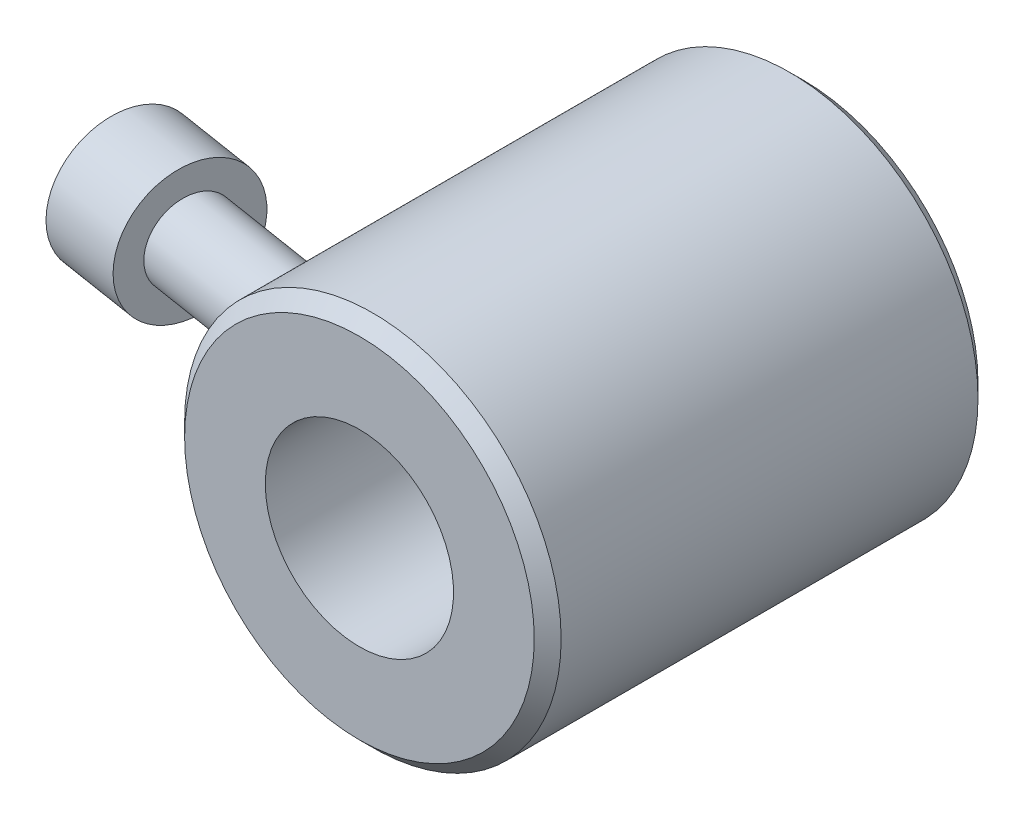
ISO-10303-21;
HEADER;
FILE_DESCRIPTION(('STEP AP214'),'2;1');
FILE_NAME('part.step','',(''),(''),'','','');
FILE_SCHEMA(('AUTOMOTIVE_DESIGN { 1 0 10303 214 1 1 1 1 }'));
ENDSEC;
DATA;
#1=APPLICATION_CONTEXT('core data for automotive mechanical design processes');
#2=APPLICATION_PROTOCOL_DEFINITION('international standard','automotive_design',2000,#1);
#3=PRODUCT_CONTEXT('',#1,'mechanical');
#4=PRODUCT('Part','Part','',(#3));
#5=PRODUCT_RELATED_PRODUCT_CATEGORY('part','',(#4));
#6=PRODUCT_DEFINITION_FORMATION('','',#4);
#7=PRODUCT_DEFINITION_CONTEXT('part definition',#1,'design');
#8=PRODUCT_DEFINITION('design','',#6,#7);
#9=PRODUCT_DEFINITION_SHAPE('','',#8);
#10=(LENGTH_UNIT() NAMED_UNIT(*) SI_UNIT(.MILLI.,.METRE.));
#11=(NAMED_UNIT(*) PLANE_ANGLE_UNIT() SI_UNIT($,.RADIAN.));
#12=(NAMED_UNIT(*) SI_UNIT($,.STERADIAN.) SOLID_ANGLE_UNIT());
#13=UNCERTAINTY_MEASURE_WITH_UNIT(LENGTH_MEASURE(1.E-05),#10,'distance_accuracy_value','');
#14=(GEOMETRIC_REPRESENTATION_CONTEXT(3) GLOBAL_UNCERTAINTY_ASSIGNED_CONTEXT((#13)) GLOBAL_UNIT_ASSIGNED_CONTEXT((#10,
#11,#12)) REPRESENTATION_CONTEXT('',''));
#15=CARTESIAN_POINT('',(0.,0.,0.));
#16=DIRECTION('',(0.,0.,1.));
#17=DIRECTION('',(1.,0.,0.));
#18=AXIS2_PLACEMENT_3D('',#15,#16,#17);
#19=CARTESIAN_POINT('',(-22.4207300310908,0.,6.66628738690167));
#20=DIRECTION('',(-0.987688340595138,0.,-0.156434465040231));
#21=DIRECTION('',(-0.156434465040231,0.,0.987688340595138));
#22=AXIS2_PLACEMENT_3D('',#19,#20,#21);
#23=CYLINDRICAL_SURFACE('',#22,1.25);
#24=CARTESIAN_POINT('',(-14.,0.,9.265581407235));
#25=CARTESIAN_POINT('',(-13.9999992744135,0.0700489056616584,9.26557846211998));
#26=CARTESIAN_POINT('',(-13.9994686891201,0.140145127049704,9.25968411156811));
#27=CARTESIAN_POINT('',(-13.9974028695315,0.278403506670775,9.23624875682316));
#28=CARTESIAN_POINT('',(-13.9958665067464,0.346563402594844,9.21869466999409));
#29=CARTESIAN_POINT('',(-13.991962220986,0.478932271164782,9.17242700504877));
#30=CARTESIAN_POINT('',(-13.9895946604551,0.54314295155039,9.14371829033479));
#31=CARTESIAN_POINT('',(-13.9842942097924,0.665799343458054,9.07594885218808));
#32=CARTESIAN_POINT('',(-13.9813614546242,0.724246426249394,9.03689059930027));
#33=CARTESIAN_POINT('',(-13.9752599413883,0.833739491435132,8.94951878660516));
#34=CARTESIAN_POINT('',(-13.9720911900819,0.884785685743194,8.90120549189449));
#35=CARTESIAN_POINT('',(-13.9658731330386,0.978048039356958,8.79669132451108));
#36=CARTESIAN_POINT('',(-13.962823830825,1.02026393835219,8.74049021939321));
#37=CARTESIAN_POINT('',(-13.9571815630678,1.09475351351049,8.62172436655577));
#38=CARTESIAN_POINT('',(-13.9545891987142,1.12701413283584,8.5591514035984));
#39=CARTESIAN_POINT('',(-13.9501524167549,1.18066768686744,8.42948568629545));
#40=CARTESIAN_POINT('',(-13.9483080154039,1.20206038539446,8.36239283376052));
#41=CARTESIAN_POINT('',(-13.9455579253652,1.2335592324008,8.22514336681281));
#42=CARTESIAN_POINT('',(-13.9446582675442,1.24359290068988,8.1549700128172));
#43=CARTESIAN_POINT('',(-13.9439113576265,1.25193996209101,8.01392542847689));
#44=CARTESIAN_POINT('',(-13.9440641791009,1.25025253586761,7.94305414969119));
#45=CARTESIAN_POINT('',(-13.945406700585,1.23518787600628,7.80167436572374));
#46=CARTESIAN_POINT('',(-13.946609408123,1.22166398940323,7.73118161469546));
#47=CARTESIAN_POINT('',(-13.9499289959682,1.18315306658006,7.59342024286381));
#48=CARTESIAN_POINT('',(-13.952045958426,1.15816500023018,7.52615191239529));
#49=CARTESIAN_POINT('',(-13.9569842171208,1.09705886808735,7.39593546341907));
#50=CARTESIAN_POINT('',(-13.9598134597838,1.06081407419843,7.33304705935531));
#51=CARTESIAN_POINT('',(-13.9658404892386,0.978266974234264,7.21427220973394));
#52=CARTESIAN_POINT('',(-13.9690382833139,0.931964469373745,7.15838590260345));
#53=CARTESIAN_POINT('',(-13.9754283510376,0.830642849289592,7.05539857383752));
#54=CARTESIAN_POINT('',(-13.9786206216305,0.775642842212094,7.00827877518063));
#55=CARTESIAN_POINT('',(-13.9846348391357,0.658352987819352,6.92417260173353));
#56=CARTESIAN_POINT('',(-13.9874568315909,0.596064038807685,6.88718498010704));
#57=CARTESIAN_POINT('',(-13.9923426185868,0.467338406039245,6.82525143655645));
#58=CARTESIAN_POINT('',(-13.9944210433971,0.401015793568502,6.80006972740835));
#59=CARTESIAN_POINT('',(-13.9976566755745,0.265005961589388,6.76149804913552));
#60=CARTESIAN_POINT('',(-13.9988140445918,0.195319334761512,6.7481060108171));
#61=CARTESIAN_POINT('',(-14.0000537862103,0.0564809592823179,6.73378130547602));
#62=CARTESIAN_POINT('',(-14.0001629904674,-0.012638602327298,6.7325376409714));
#63=CARTESIAN_POINT('',(-13.9993641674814,-0.150084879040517,6.74174192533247));
#64=CARTESIAN_POINT('',(-13.9984562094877,-0.218411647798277,6.75218907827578));
#65=CARTESIAN_POINT('',(-13.9957384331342,-0.351734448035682,6.78427012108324));
#66=CARTESIAN_POINT('',(-13.9939364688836,-0.416754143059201,6.80580664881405));
#67=CARTESIAN_POINT('',(-13.9896331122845,-0.542325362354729,6.85930191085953));
#68=CARTESIAN_POINT('',(-13.9871316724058,-0.602876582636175,6.89126135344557));
#69=CARTESIAN_POINT('',(-13.981655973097,-0.718833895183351,6.96518384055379));
#70=CARTESIAN_POINT('',(-13.9786749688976,-0.774145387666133,7.00729465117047));
#71=CARTESIAN_POINT('',(-13.9725910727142,-0.877134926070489,7.09998808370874));
#72=CARTESIAN_POINT('',(-13.9694881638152,-0.924811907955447,7.15057188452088));
#73=CARTESIAN_POINT('',(-13.9634106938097,-1.01249626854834,7.26021995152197));
#74=CARTESIAN_POINT('',(-13.9604416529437,-1.05226901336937,7.31947223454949));
#75=CARTESIAN_POINT('',(-13.9550500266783,-1.12151209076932,7.44374331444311));
#76=CARTESIAN_POINT('',(-13.9526274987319,-1.15098134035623,7.50876271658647));
#77=CARTESIAN_POINT('',(-13.9485640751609,-1.19923334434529,7.64391724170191));
#78=CARTESIAN_POINT('',(-13.9469369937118,-1.21782826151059,7.7141199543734));
#79=CARTESIAN_POINT('',(-13.9447171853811,-1.24299013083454,7.85666739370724));
#80=CARTESIAN_POINT('',(-13.9441244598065,-1.24955706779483,7.92901212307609));
#81=CARTESIAN_POINT('',(-13.9440490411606,-1.25039868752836,8.07363983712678));
#82=CARTESIAN_POINT('',(-13.9445642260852,-1.24469686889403,8.14592267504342));
#83=CARTESIAN_POINT('',(-13.9466486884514,-1.2211178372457,8.28846013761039));
#84=CARTESIAN_POINT('',(-13.9482178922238,-1.2032414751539,8.35871490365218));
#85=CARTESIAN_POINT('',(-13.9522068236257,-1.15605945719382,8.49422472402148));
#86=CARTESIAN_POINT('',(-13.9546152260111,-1.12690544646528,8.5595329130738));
#87=CARTESIAN_POINT('',(-13.9600126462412,-1.05794026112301,8.68422725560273));
#88=CARTESIAN_POINT('',(-13.9630016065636,-1.01813014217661,8.74361399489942));
#89=CARTESIAN_POINT('',(-13.969180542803,-0.929483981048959,8.85408358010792));
#90=CARTESIAN_POINT('',(-13.9723678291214,-0.880756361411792,8.9052536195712));
#91=CARTESIAN_POINT('',(-13.9786132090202,-0.775341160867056,8.99864440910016));
#92=CARTESIAN_POINT('',(-13.9816712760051,-0.718651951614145,9.04086332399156));
#93=CARTESIAN_POINT('',(-13.9872981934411,-0.599204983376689,9.11497471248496));
#94=CARTESIAN_POINT('',(-13.9898690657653,-0.536474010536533,9.14691026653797));
#95=CARTESIAN_POINT('',(-13.9942455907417,-0.406567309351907,9.19977912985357));
#96=CARTESIAN_POINT('',(-13.9960521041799,-0.339396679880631,9.22072482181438));
#97=CARTESIAN_POINT('',(-13.9982381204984,-0.226533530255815,9.24575973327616));
#98=CARTESIAN_POINT('',(-13.9988958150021,-0.181557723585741,9.25318335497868));
#99=CARTESIAN_POINT('',(-13.999776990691,-0.0910612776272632,9.26309515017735));
#100=CARTESIAN_POINT('',(-14.0000004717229,-0.0455406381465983,9.26558332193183));
#101=CARTESIAN_POINT('',(-14.,0.,9.265581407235));
#102=B_SPLINE_CURVE_WITH_KNOTS('',3,(#24,#25,#26,#27,#28,#29,#30,#31,#32,#33,#34,#35,#36,#37,
#38,#39,#40,#41,#42,#43,#44,#45,#46,#47,#48,#49,#50,#51,#52,#53,#54,#55,#56,#57,#58,#59,#60,#61,
#62,#63,#64,#65,#66,#67,#68,#69,#70,#71,#72,#73,#74,#75,#76,#77,#78,#79,#80,#81,#82,#83,#84,#85,
#86,#87,#88,#89,#90,#91,#92,#93,#94,#95,#96,#97,#98,#99,#100,#101),.UNSPECIFIED.,.T.,.F.,(4,2,2,
2,2,2,2,2,2,2,2,2,2,2,2,2,2,2,2,2,2,2,2,2,2,2,2,2,2,2,2,2,2,2,2,2,2,2,4),(0.,0.209980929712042,
0.42019786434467,0.630323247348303,0.840398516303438,1.05046776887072,1.26054321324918,
1.4708930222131,1.68124740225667,1.89293658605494,2.10464056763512,2.31900528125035,
2.53338926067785,2.75028006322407,2.96717515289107,3.18360018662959,3.39999857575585,
3.61186862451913,3.82370148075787,4.0300967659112,4.23647800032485,4.44107739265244,
4.64569069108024,4.85348431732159,5.06130687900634,5.27459406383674,5.48790366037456,
5.70479661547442,5.92168984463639,6.13816802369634,6.354631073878,6.56827931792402,
6.7819064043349,6.99309054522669,7.204317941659,7.41464856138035,7.62474168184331,
7.76125576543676,7.89776989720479),.UNSPECIFIED.);
#103=CARTESIAN_POINT('',(-14.,0.,9.265581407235));
#104=VERTEX_POINT('',#103);
#105=EDGE_CURVE('E149',#104,#104,#102,.T.);
#106=ORIENTED_EDGE('',*,*,#105,.T.);
#107=EDGE_LOOP('',(#106));
#108=FACE_BOUND('',#107,.T.);
#109=CARTESIAN_POINT('',(-10.2212553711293,0.,9.86407576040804));
#110=CARTESIAN_POINT('',(-10.2212544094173,0.070151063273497,9.86407295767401));
#111=CARTESIAN_POINT('',(-10.2205256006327,0.14034638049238,9.85819293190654));
#112=CARTESIAN_POINT('',(-10.2176877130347,0.27879800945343,9.83481128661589));
#113=CARTESIAN_POINT('',(-10.2155771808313,0.347052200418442,9.81729742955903));
#114=CARTESIAN_POINT('',(-10.2102123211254,0.479608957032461,9.7711204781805));
#115=CARTESIAN_POINT('',(-10.2069584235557,0.543912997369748,9.74246157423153));
#116=CARTESIAN_POINT('',(-10.1996716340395,0.666745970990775,9.67478049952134));
#117=CARTESIAN_POINT('',(-10.1956389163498,0.725276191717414,9.63576064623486));
#118=CARTESIAN_POINT('',(-10.1872509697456,0.834866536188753,9.54846790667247));
#119=CARTESIAN_POINT('',(-10.1828960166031,0.885932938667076,9.50020287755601));
#120=CARTESIAN_POINT('',(-10.174350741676,0.979207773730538,9.39574832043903));
#121=CARTESIAN_POINT('',(-10.1701604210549,1.02141614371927,9.33955873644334));
#122=CARTESIAN_POINT('',(-10.1624222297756,1.09573481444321,9.22095193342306));
#123=CARTESIAN_POINT('',(-10.1588732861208,1.12786204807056,9.15854539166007));
#124=CARTESIAN_POINT('',(-10.152803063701,1.18126101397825,9.02920568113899));
#125=CARTESIAN_POINT('',(-10.1502817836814,1.20253275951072,8.96227251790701));
#126=CARTESIAN_POINT('',(-10.1465335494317,1.23376213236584,8.82555598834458));
#127=CARTESIAN_POINT('',(-10.145310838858,1.24368267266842,8.75576404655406));
#128=CARTESIAN_POINT('',(-10.1442975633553,1.25192072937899,8.61549077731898));
#129=CARTESIAN_POINT('',(-10.1445071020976,1.25023740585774,8.54500940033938));
#130=CARTESIAN_POINT('',(-10.1463343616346,1.23532050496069,8.4043232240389));
#131=CARTESIAN_POINT('',(-10.1479713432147,1.22192893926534,8.33413545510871));
#132=CARTESIAN_POINT('',(-10.152485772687,1.18383213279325,8.19694032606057));
#133=CARTESIAN_POINT('',(-10.1553633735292,1.15912549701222,8.12993335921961));
#134=CARTESIAN_POINT('',(-10.1620944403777,1.09856216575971,7.99977033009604));
#135=CARTESIAN_POINT('',(-10.1659641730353,1.06251708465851,7.93670267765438));
#136=CARTESIAN_POINT('',(-10.1742124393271,0.980387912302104,7.81751147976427));
#137=CARTESIAN_POINT('',(-10.1785910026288,0.934303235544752,7.76138833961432));
#138=CARTESIAN_POINT('',(-10.187367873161,0.833170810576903,7.65762608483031));
#139=CARTESIAN_POINT('',(-10.1917662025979,0.778102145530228,7.61000732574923));
#140=CARTESIAN_POINT('',(-10.2000584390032,0.660554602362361,7.52495337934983));
#141=CARTESIAN_POINT('',(-10.2039524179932,0.598076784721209,7.48751673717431));
#142=CARTESIAN_POINT('',(-10.2106867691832,0.469047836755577,7.42489820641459));
#143=CARTESIAN_POINT('',(-10.2135501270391,0.402629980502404,7.39944446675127));
#144=CARTESIAN_POINT('',(-10.2180114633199,0.26635165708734,7.36042170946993));
#145=CARTESIAN_POINT('',(-10.2196097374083,0.196491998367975,7.34684991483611));
#146=CARTESIAN_POINT('',(-10.2213193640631,0.0578075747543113,7.33235429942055));
#147=CARTESIAN_POINT('',(-10.2214783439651,-0.0109744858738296,7.33102532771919));
#148=CARTESIAN_POINT('',(-10.2204161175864,-0.14775884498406,7.34000539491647));
#149=CARTESIAN_POINT('',(-10.219195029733,-0.215761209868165,7.35031343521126));
#150=CARTESIAN_POINT('',(-10.215533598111,-0.348252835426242,7.38200152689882));
#151=CARTESIAN_POINT('',(-10.2131075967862,-0.412773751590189,7.4032514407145));
#152=CARTESIAN_POINT('',(-10.2073082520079,-0.537416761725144,7.45602460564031));
#153=CARTESIAN_POINT('',(-10.2039348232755,-0.597538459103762,7.48754878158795));
#154=CARTESIAN_POINT('',(-10.1965225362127,-0.713028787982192,7.56061592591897));
#155=CARTESIAN_POINT('',(-10.192471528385,-0.768275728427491,7.60234980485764));
#156=CARTESIAN_POINT('',(-10.1841867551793,-0.87124939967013,7.69422843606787));
#157=CARTESIAN_POINT('',(-10.1799529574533,-0.918974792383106,7.74437468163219));
#158=CARTESIAN_POINT('',(-10.171607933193,-1.00721761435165,7.85348255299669));
#159=CARTESIAN_POINT('',(-10.1675055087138,-1.04744143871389,7.9126824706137));
#160=CARTESIAN_POINT('',(-10.1600313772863,-1.11761966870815,8.03693068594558));
#161=CARTESIAN_POINT('',(-10.156659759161,-1.14757282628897,8.10197969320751));
#162=CARTESIAN_POINT('',(-10.1509722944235,-1.19685166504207,8.23740533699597));
#163=CARTESIAN_POINT('',(-10.1486771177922,-1.21597064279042,8.30785823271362));
#164=CARTESIAN_POINT('',(-10.145512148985,-1.24210328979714,8.45100864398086));
#165=CARTESIAN_POINT('',(-10.1446423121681,-1.2491173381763,8.5237060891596));
#166=CARTESIAN_POINT('',(-10.1444448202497,-1.25072041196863,8.66874098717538));
#167=CARTESIAN_POINT('',(-10.1451065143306,-1.24539524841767,8.74107744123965));
#168=CARTESIAN_POINT('',(-10.1478874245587,-1.22252745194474,8.88376455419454));
#169=CARTESIAN_POINT('',(-10.1500064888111,-1.2049860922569,8.95411541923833));
#170=CARTESIAN_POINT('',(-10.1554124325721,-1.15852998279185,9.08947747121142));
#171=CARTESIAN_POINT('',(-10.1586774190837,-1.1298274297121,9.15456239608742));
#172=CARTESIAN_POINT('',(-10.1660110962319,-1.06181173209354,9.27887633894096));
#173=CARTESIAN_POINT('',(-10.1700797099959,-1.02249960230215,9.33810591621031));
#174=CARTESIAN_POINT('',(-10.1785057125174,-0.934875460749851,9.44835672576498));
#175=CARTESIAN_POINT('',(-10.1828593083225,-0.886670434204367,9.49946333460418));
#176=CARTESIAN_POINT('',(-10.1914066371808,-0.782321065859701,9.59284369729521));
#177=CARTESIAN_POINT('',(-10.1956003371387,-0.726175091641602,9.6351156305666));
#178=CARTESIAN_POINT('',(-10.2033522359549,-0.60760876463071,9.70960806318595));
#179=CARTESIAN_POINT('',(-10.2069109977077,-0.545194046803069,9.74183748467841));
#180=CARTESIAN_POINT('',(-10.2129966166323,-0.415856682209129,9.79539488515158));
#181=CARTESIAN_POINT('',(-10.215524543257,-0.348938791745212,9.8167341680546));
#182=CARTESIAN_POINT('',(-10.2186636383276,-0.234740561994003,9.84289038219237));
#183=CARTESIAN_POINT('',(-10.2196308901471,-0.18815931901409,9.85082456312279));
#184=CARTESIAN_POINT('',(-10.2209270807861,-0.0943920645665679,9.861418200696));
#185=CARTESIAN_POINT('',(-10.2212560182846,-0.0472060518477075,9.86407764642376));
#186=CARTESIAN_POINT('',(-10.2212553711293,0.,9.86407576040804));
#187=B_SPLINE_CURVE_WITH_KNOTS('',3,(#109,#110,#111,#112,#113,#114,#115,#116,#117,#118,#119,
#120,#121,#122,#123,#124,#125,#126,#127,#128,#129,#130,#131,#132,#133,#134,#135,#136,#137,#138,
#139,#140,#141,#142,#143,#144,#145,#146,#147,#148,#149,#150,#151,#152,#153,#154,#155,#156,#157,
#158,#159,#160,#161,#162,#163,#164,#165,#166,#167,#168,#169,#170,#171,#172,#173,#174,#175,#176,
#177,#178,#179,#180,#181,#182,#183,#184,#185,#186),.UNSPECIFIED.,.T.,.F.,(4,2,2,2,2,2,2,2,2,2,2,
2,2,2,2,2,2,2,2,2,2,2,2,2,2,2,2,2,2,2,2,2,2,2,2,2,2,2,4),(0.,0.210281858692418,
0.420785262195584,0.631209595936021,0.841586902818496,1.05178620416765,1.26198699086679,
1.47183279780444,1.6816783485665,1.89220757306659,2.10275203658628,2.31618216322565,
2.52963861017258,2.74684769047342,2.96406944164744,3.18180434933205,3.39950812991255,
3.61200157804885,3.82444534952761,4.02983241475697,4.23520185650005,4.4381832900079,
4.64118299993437,4.84831568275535,5.05548517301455,5.26956651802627,5.48367386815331,
5.70173935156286,5.91979800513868,6.13634476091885,6.352868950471,6.56546338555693,
6.77803749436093,6.98820378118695,7.19841333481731,7.40843559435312,7.61823940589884,
7.7597419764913,7.90124483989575),.UNSPECIFIED.);
#188=CARTESIAN_POINT('',(-10.2212553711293,0.,9.86407576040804));
#189=VERTEX_POINT('',#188);
#190=EDGE_CURVE('E11',#189,#189,#187,.T.);
#191=ORIENTED_EDGE('',*,*,#190,.F.);
#192=EDGE_LOOP('',(#191));
#193=FACE_BOUND('',#192,.T.);
#194=ADVANCED_FACE('F16',(#108,#193),#23,.F.);
#195=CARTESIAN_POINT('',(0.,-4.,21.));
#196=DIRECTION('',(0.,-1.,0.));
#197=DIRECTION('',(0.,0.,-1.));
#198=AXIS2_PLACEMENT_3D('',#195,#196,#197);
#199=CYLINDRICAL_SURFACE('',#198,2.);
#200=CARTESIAN_POINT('',(0.,-12.,21.));
#201=DIRECTION('',(0.,-1.,0.));
#202=DIRECTION('',(0.,0.,-1.));
#203=AXIS2_PLACEMENT_3D('',#200,#201,#202);
#204=CIRCLE('',#203,2.);
#205=CARTESIAN_POINT('',(0.,-12.,19.));
#206=VERTEX_POINT('',#205);
#207=EDGE_CURVE('E29',#206,#206,#204,.T.);
#208=ORIENTED_EDGE('',*,*,#207,.F.);
#209=EDGE_LOOP('',(#208));
#210=FACE_BOUND('',#209,.T.);
#211=CARTESIAN_POINT('',(0.,-14.,19.));
#212=CARTESIAN_POINT('',(-0.111730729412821,-13.9999982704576,19.0000046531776));
#213=CARTESIAN_POINT('',(-0.223527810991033,-13.9986484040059,19.0093944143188));
#214=CARTESIAN_POINT('',(-0.444001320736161,-13.9933934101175,19.046698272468));
#215=CARTESIAN_POINT('',(-0.552674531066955,-13.9894857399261,19.0746308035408));
#216=CARTESIAN_POINT('',(-0.763677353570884,-13.9795546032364,19.1481721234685));
#217=CARTESIAN_POINT('',(-0.866011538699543,-13.9735326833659,19.193767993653));
#218=CARTESIAN_POINT('',(-1.06155930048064,-13.9600397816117,19.3013110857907));
#219=CARTESIAN_POINT('',(-1.1547742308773,-13.9525690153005,19.3632558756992));
#220=CARTESIAN_POINT('',(-1.33011730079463,-13.9369507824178,19.5022083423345));
#221=CARTESIAN_POINT('',(-1.41217118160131,-13.9287993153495,19.5793092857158));
#222=CARTESIAN_POINT('',(-1.56222258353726,-13.9127699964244,19.7461848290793));
#223=CARTESIAN_POINT('',(-1.63021932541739,-13.9048921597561,19.8359601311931));
#224=CARTESIAN_POINT('',(-1.75051175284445,-13.8902631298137,20.0261302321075));
#225=CARTESIAN_POINT('',(-1.80273625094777,-13.8835171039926,20.1265704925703));
#226=CARTESIAN_POINT('',(-1.8895469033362,-13.8719696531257,20.3349090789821));
#227=CARTESIAN_POINT('',(-1.92413392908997,-13.8671681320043,20.4428070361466));
#228=CARTESIAN_POINT('',(-1.97445864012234,-13.8600923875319,20.662220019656));
#229=CARTESIAN_POINT('',(-1.99032297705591,-13.8578011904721,20.7737054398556));
#230=CARTESIAN_POINT('',(-2.00314420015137,-13.8559538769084,20.9977778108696));
#231=CARTESIAN_POINT('',(-2.00010207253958,-13.8563976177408,21.1103647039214));
#232=CARTESIAN_POINT('',(-1.97530036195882,-13.8599545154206,21.3325530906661));
#233=CARTESIAN_POINT('',(-1.953681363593,-13.8630476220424,21.4421706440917));
#234=CARTESIAN_POINT('',(-1.89255944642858,-13.8715234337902,21.6562061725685));
#235=CARTESIAN_POINT('',(-1.85305606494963,-13.8769061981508,21.7606240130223));
#236=CARTESIAN_POINT('',(-1.75713904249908,-13.8893771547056,21.9617265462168));
#237=CARTESIAN_POINT('',(-1.70066538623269,-13.8964713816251,22.0583822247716));
#238=CARTESIAN_POINT('',(-1.57245369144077,-13.9115614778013,22.2408984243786));
#239=CARTESIAN_POINT('',(-1.50071474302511,-13.9195574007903,22.3267583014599));
#240=CARTESIAN_POINT('',(-1.34323491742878,-13.935638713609,22.4860608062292));
#241=CARTESIAN_POINT('',(-1.25737307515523,-13.9437242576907,22.5593838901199));
#242=CARTESIAN_POINT('',(-1.07449831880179,-13.9590063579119,22.6905970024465));
#243=CARTESIAN_POINT('',(-0.977485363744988,-13.9662029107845,22.7484869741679));
#244=CARTESIAN_POINT('',(-0.774962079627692,-13.9789027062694,22.8471948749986));
#245=CARTESIAN_POINT('',(-0.669447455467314,-13.9844050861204,22.8880041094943));
#246=CARTESIAN_POINT('',(-0.4529666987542,-13.9930891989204,22.9512909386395));
#247=CARTESIAN_POINT('',(-0.342000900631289,-13.9962710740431,22.9737696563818));
#248=CARTESIAN_POINT('',(-0.118800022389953,-13.9999369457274,22.9995996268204));
#249=CARTESIAN_POINT('',(-0.00658433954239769,-14.0004441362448,23.0031153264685));
#250=CARTESIAN_POINT('',(0.216834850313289,-13.998766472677,22.9913551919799));
#251=CARTESIAN_POINT('',(0.32803838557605,-13.9965816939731,22.9760798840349));
#252=CARTESIAN_POINT('',(0.545782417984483,-13.989779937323,22.9273080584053));
#253=CARTESIAN_POINT('',(0.652341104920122,-13.9851735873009,22.8938911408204));
#254=CARTESIAN_POINT('',(0.858342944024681,-13.9740437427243,22.8098682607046));
#255=CARTESIAN_POINT('',(0.957785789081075,-13.9675201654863,22.7592615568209));
#256=CARTESIAN_POINT('',(1.14745969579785,-13.9532237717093,22.6419061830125));
#257=CARTESIAN_POINT('',(1.23762521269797,-13.9454429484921,22.5750525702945));
#258=CARTESIAN_POINT('',(1.40551529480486,-13.9295244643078,22.4272479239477));
#259=CARTESIAN_POINT('',(1.48323920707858,-13.9213867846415,22.3462961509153));
#260=CARTESIAN_POINT('',(1.62463364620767,-13.905598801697,22.1718632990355));
#261=CARTESIAN_POINT('',(1.68819430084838,-13.8979526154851,22.0782927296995));
#262=CARTESIAN_POINT('',(1.79869568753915,-13.8840847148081,21.881706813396));
#263=CARTESIAN_POINT('',(1.84563683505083,-13.8778629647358,21.7786917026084));
#264=CARTESIAN_POINT('',(1.92139410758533,-13.8675777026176,21.5664766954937));
#265=CARTESIAN_POINT('',(1.9502693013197,-13.8635071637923,21.4572982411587));
#266=CARTESIAN_POINT('',(1.98926373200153,-13.8579660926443,21.2355794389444));
#267=CARTESIAN_POINT('',(1.99938413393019,-13.8564953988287,21.1230393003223));
#268=CARTESIAN_POINT('',(2.0005559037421,-13.8563261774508,20.8988861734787));
#269=CARTESIAN_POINT('',(1.99177997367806,-13.8576025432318,20.7872740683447));
#270=CARTESIAN_POINT('',(1.955776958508,-13.8627292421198,20.5671298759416));
#271=CARTESIAN_POINT('',(1.9285498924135,-13.8665795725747,20.458597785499));
#272=CARTESIAN_POINT('',(1.85647645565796,-13.8764118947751,20.2477347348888));
#273=CARTESIAN_POINT('',(1.81164102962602,-13.8823925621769,20.145399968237));
#274=CARTESIAN_POINT('',(1.70564064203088,-13.8958134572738,19.9496775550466));
#275=CARTESIAN_POINT('',(1.6444752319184,-13.9032537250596,19.8562901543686));
#276=CARTESIAN_POINT('',(1.50691947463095,-13.9188366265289,19.6802341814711));
#277=CARTESIAN_POINT('',(1.43040092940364,-13.9269848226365,19.5976662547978));
#278=CARTESIAN_POINT('',(1.26458151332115,-13.9430182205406,19.4464802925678));
#279=CARTESIAN_POINT('',(1.17527766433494,-13.9509033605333,19.3778655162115));
#280=CARTESIAN_POINT('',(0.985903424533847,-13.9655666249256,19.2562324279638));
#281=CARTESIAN_POINT('',(0.885781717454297,-13.9723390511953,19.2032933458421));
#282=CARTESIAN_POINT('',(0.678021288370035,-13.9839575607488,19.1150602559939));
#283=CARTESIAN_POINT('',(0.570390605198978,-13.9888056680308,19.0797476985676));
#284=CARTESIAN_POINT('',(0.385211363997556,-13.9949036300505,19.0359164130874));
#285=CARTESIAN_POINT('',(0.308813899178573,-13.9968051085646,19.0224679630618));
#286=CARTESIAN_POINT('',(0.154954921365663,-13.9993538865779,19.0045081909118));
#287=CARTESIAN_POINT('',(0.0774934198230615,-14.0000011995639,18.9999967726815));
#288=CARTESIAN_POINT('',(0.,-14.,19.));
#289=B_SPLINE_CURVE_WITH_KNOTS('',3,(#211,#212,#213,#214,#215,#216,#217,#218,#219,#220,#221,
#222,#223,#224,#225,#226,#227,#228,#229,#230,#231,#232,#233,#234,#235,#236,#237,#238,#239,#240,
#241,#242,#243,#244,#245,#246,#247,#248,#249,#250,#251,#252,#253,#254,#255,#256,#257,#258,#259,
#260,#261,#262,#263,#264,#265,#266,#267,#268,#269,#270,#271,#272,#273,#274,#275,#276,#277,#278,
#279,#280,#281,#282,#283,#284,#285,#286,#287,#288),.UNSPECIFIED.,.T.,.F.,(4,2,2,2,2,2,2,2,2,2,2,
2,2,2,2,2,2,2,2,2,2,2,2,2,2,2,2,2,2,2,2,2,2,2,2,2,2,2,4),(0.,0.334909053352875,
0.670151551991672,1.00514932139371,1.34009728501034,1.67717486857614,2.01427113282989,
2.35286688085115,2.69144589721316,3.02772118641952,3.36397893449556,3.69771416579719,
4.03145803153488,4.36639635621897,4.70135465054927,5.03934756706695,5.3773417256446,
5.71550772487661,6.05365300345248,6.38886112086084,6.7240598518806,7.0577995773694,
7.3915536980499,7.72752375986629,8.06351144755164,8.40202124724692,8.74052258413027,
9.07791128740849,9.4152790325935,9.74957651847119,10.0838736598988,10.4179633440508,
10.752062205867,11.0890764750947,11.4261693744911,11.7649380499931,12.1033494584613,
12.3356358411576,12.5679197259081),.UNSPECIFIED.);
#290=CARTESIAN_POINT('',(0.,-14.,19.));
#291=VERTEX_POINT('',#290);
#292=EDGE_CURVE('E141',#291,#291,#289,.T.);
#293=ORIENTED_EDGE('',*,*,#292,.F.);
#294=EDGE_LOOP('',(#293));
#295=FACE_BOUND('',#294,.T.);
#296=ADVANCED_FACE('F157',(#210,#295),#199,.F.);
#297=CARTESIAN_POINT('',(0.,0.,0.));
#298=DIRECTION('',(0.,0.,1.));
#299=DIRECTION('',(1.,0.,0.));
#300=AXIS2_PLACEMENT_3D('',#297,#298,#299);
#301=CYLINDRICAL_SURFACE('',#300,14.);
#302=CARTESIAN_POINT('',(0.,0.,1.));
#303=DIRECTION('',(0.,0.,-1.));
#304=DIRECTION('',(-1.,0.,0.));
#305=AXIS2_PLACEMENT_3D('',#302,#303,#304);
#306=CIRCLE('',#305,14.);
#307=CARTESIAN_POINT('',(-14.,0.,1.));
#308=VERTEX_POINT('',#307);
#309=EDGE_CURVE('E185',#308,#308,#306,.F.);
#310=ORIENTED_EDGE('',*,*,#309,.T.);
#311=EDGE_LOOP('',(#310));
#312=FACE_BOUND('',#311,.T.);
#313=CARTESIAN_POINT('',(0.,0.,32.));
#314=DIRECTION('',(0.,0.,1.));
#315=DIRECTION('',(1.,0.,0.));
#316=AXIS2_PLACEMENT_3D('',#313,#314,#315);
#317=CIRCLE('',#316,14.);
#318=CARTESIAN_POINT('',(14.,0.,32.));
#319=VERTEX_POINT('',#318);
#320=EDGE_CURVE('E182',#319,#319,#317,.F.);
#321=ORIENTED_EDGE('',*,*,#320,.T.);
#322=EDGE_LOOP('',(#321));
#323=FACE_BOUND('',#322,.T.);
#324=ORIENTED_EDGE('',*,*,#105,.F.);
#325=EDGE_LOOP('',(#324));
#326=FACE_BOUND('',#325,.T.);
#327=CARTESIAN_POINT('',(-14.,0.,25.0341274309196));
#328=CARTESIAN_POINT('',(-13.9999967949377,0.168510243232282,25.0341221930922));
#329=CARTESIAN_POINT('',(-13.9969271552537,0.337094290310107,25.0201957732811));
#330=CARTESIAN_POINT('',(-13.9849715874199,0.669555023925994,24.9648179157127));
#331=CARTESIAN_POINT('',(-13.9760813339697,0.833428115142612,24.9233460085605));
#332=CARTESIAN_POINT('',(-13.9534610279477,1.15168232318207,24.8139527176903));
#333=CARTESIAN_POINT('',(-13.9397327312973,1.30606685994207,24.7460409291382));
#334=CARTESIAN_POINT('',(-13.9089449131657,1.60101990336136,24.585515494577));
#335=CARTESIAN_POINT('',(-13.8918858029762,1.74159011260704,24.4929048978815));
#336=CARTESIAN_POINT('',(-13.8563175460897,2.00503649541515,24.2853044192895));
#337=CARTESIAN_POINT('',(-13.8378075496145,2.12790217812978,24.1703013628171));
#338=CARTESIAN_POINT('',(-13.8014344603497,2.35230999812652,23.9210010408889));
#339=CARTESIAN_POINT('',(-13.7835713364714,2.45385316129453,23.7867047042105));
#340=CARTESIAN_POINT('',(-13.7506600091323,2.63201983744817,23.5035894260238));
#341=CARTESIAN_POINT('',(-13.7355918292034,2.70882333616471,23.3548861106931));
#342=CARTESIAN_POINT('',(-13.7098167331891,2.83640424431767,23.0463653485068));
#343=CARTESIAN_POINT('',(-13.6991093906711,2.88718419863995,22.8865489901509));
#344=CARTESIAN_POINT('',(-13.6833145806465,2.96113670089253,22.5620164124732));
#345=CARTESIAN_POINT('',(-13.678174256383,2.98456907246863,22.3973618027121));
#346=CARTESIAN_POINT('',(-13.6738246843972,3.00443368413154,22.0663677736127));
#347=CARTESIAN_POINT('',(-13.6746157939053,3.00086429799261,21.9000282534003));
#348=CARTESIAN_POINT('',(-13.6819874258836,2.9670717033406,21.568147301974));
#349=CARTESIAN_POINT('',(-13.6886395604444,2.93651878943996,21.4026412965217));
#350=CARTESIAN_POINT('',(-13.7070057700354,2.84955215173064,21.0788636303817));
#351=CARTESIAN_POINT('',(-13.7187209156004,2.79313295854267,20.9205935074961));
#352=CARTESIAN_POINT('',(-13.74639677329,2.65363814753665,20.6097298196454));
#353=CARTESIAN_POINT('',(-13.7624953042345,2.56967494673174,20.4575465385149));
#354=CARTESIAN_POINT('',(-13.7969051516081,2.37799586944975,20.169198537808));
#355=CARTESIAN_POINT('',(-13.8152169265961,2.27027506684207,20.0330371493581));
#356=CARTESIAN_POINT('',(-13.8524138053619,2.03114502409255,19.7778901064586));
#357=CARTESIAN_POINT('',(-13.8713028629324,1.89928479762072,19.6593264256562));
#358=CARTESIAN_POINT('',(-13.9070591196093,1.61676491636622,19.4468080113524));
#359=CARTESIAN_POINT('',(-13.9239266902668,1.46610872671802,19.3528487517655));
#360=CARTESIAN_POINT('',(-13.9531259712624,1.15495215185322,19.1955832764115));
#361=CARTESIAN_POINT('',(-13.9655807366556,0.994894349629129,19.1314266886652));
#362=CARTESIAN_POINT('',(-13.9851350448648,0.665674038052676,19.0323419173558));
#363=CARTESIAN_POINT('',(-13.9922370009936,0.496515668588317,18.9974005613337));
#364=CARTESIAN_POINT('',(-13.9999601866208,0.164539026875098,18.9594828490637));
#365=CARTESIAN_POINT('',(-14.0009354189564,0.00192682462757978,18.9547601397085));
#366=CARTESIAN_POINT('',(-13.9972387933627,-0.321677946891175,18.9728347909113));
#367=CARTESIAN_POINT('',(-13.9925677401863,-0.48267074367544,18.9956282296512));
#368=CARTESIAN_POINT('',(-13.9782819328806,-0.794662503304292,19.0669168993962));
#369=CARTESIAN_POINT('',(-13.9687839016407,-0.945806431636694,19.1148060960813));
#370=CARTESIAN_POINT('',(-13.9459117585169,-1.23817301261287,19.2341070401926));
#371=CARTESIAN_POINT('',(-13.932537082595,-1.37939421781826,19.3055222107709));
#372=CARTESIAN_POINT('',(-13.9027361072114,-1.65335871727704,19.4723915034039));
#373=CARTESIAN_POINT('',(-13.886219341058,-1.78563190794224,19.5685998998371));
#374=CARTESIAN_POINT('',(-13.8521499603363,-2.03312031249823,19.7807508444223));
#375=CARTESIAN_POINT('',(-13.834597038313,-2.14833042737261,19.8966992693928));
#376=CARTESIAN_POINT('',(-13.7992103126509,-2.36528573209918,20.1523431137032));
#377=CARTESIAN_POINT('',(-13.7814176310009,-2.46588751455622,20.2930160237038));
#378=CARTESIAN_POINT('',(-13.7485751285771,-2.64287932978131,20.5891621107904));
#379=CARTESIAN_POINT('',(-13.7335258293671,-2.7192647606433,20.7446380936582));
#380=CARTESIAN_POINT('',(-13.7075647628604,-2.84729172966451,21.0703611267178));
#381=CARTESIAN_POINT('',(-13.6967658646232,-2.89826678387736,21.2408803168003));
#382=CARTESIAN_POINT('',(-13.6812453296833,-2.97067716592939,21.5883550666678));
#383=CARTESIAN_POINT('',(-13.6765226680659,-2.99211747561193,21.765309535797));
#384=CARTESIAN_POINT('',(-13.6738903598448,-3.00412361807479,22.1159975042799));
#385=CARTESIAN_POINT('',(-13.6758169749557,-2.99543143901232,22.2897039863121));
#386=CARTESIAN_POINT('',(-13.6859977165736,-2.94856526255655,22.6328985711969));
#387=CARTESIAN_POINT('',(-13.6942504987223,-2.91039752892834,22.8023875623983));
#388=CARTESIAN_POINT('',(-13.7157581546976,-2.80724460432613,23.1261522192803));
#389=CARTESIAN_POINT('',(-13.7288298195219,-2.74323434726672,23.2807515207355));
#390=CARTESIAN_POINT('',(-13.7585167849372,-2.59022388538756,23.5766639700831));
#391=CARTESIAN_POINT('',(-13.7751318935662,-2.50122503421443,23.717977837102));
#392=CARTESIAN_POINT('',(-13.8098952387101,-2.30151160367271,23.9823889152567));
#393=CARTESIAN_POINT('',(-13.8280309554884,-2.19096601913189,24.1056155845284));
#394=CARTESIAN_POINT('',(-13.8639494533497,-1.95079942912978,24.331919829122));
#395=CARTESIAN_POINT('',(-13.8817321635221,-1.82117463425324,24.434993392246));
#396=CARTESIAN_POINT('',(-13.915198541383,-1.54492775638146,24.6193716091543));
#397=CARTESIAN_POINT('',(-13.9308567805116,-1.3981333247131,24.7004225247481));
#398=CARTESIAN_POINT('',(-13.958115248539,-1.09289844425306,24.8371247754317));
#399=CARTESIAN_POINT('',(-13.9697183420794,-0.934466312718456,24.892794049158));
#400=CARTESIAN_POINT('',(-13.9856285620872,-0.646628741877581,24.9679413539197));
#401=CARTESIAN_POINT('',(-13.9909861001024,-0.518637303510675,24.9927239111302));
#402=CARTESIAN_POINT('',(-13.9981730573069,-0.260445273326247,25.025818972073));
#403=CARTESIAN_POINT('',(-14.0000024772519,-0.130244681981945,25.0341314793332));
#404=CARTESIAN_POINT('',(-14.,0.,25.0341274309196));
#405=B_SPLINE_CURVE_WITH_KNOTS('',3,(#327,#328,#329,#330,#331,#332,#333,#334,#335,#336,#337,
#338,#339,#340,#341,#342,#343,#344,#345,#346,#347,#348,#349,#350,#351,#352,#353,#354,#355,#356,
#357,#358,#359,#360,#361,#362,#363,#364,#365,#366,#367,#368,#369,#370,#371,#372,#373,#374,#375,
#376,#377,#378,#379,#380,#381,#382,#383,#384,#385,#386,#387,#388,#389,#390,#391,#392,#393,#394,
#395,#396,#397,#398,#399,#400,#401,#402,#403,#404),.UNSPECIFIED.,.T.,.F.,(4,2,2,2,2,2,2,2,2,2,2,
2,2,2,2,2,2,2,2,2,2,2,2,2,2,2,2,2,2,2,2,2,2,2,2,2,2,2,4),(0.,0.505061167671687,1.01049807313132,
1.5157517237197,2.02094302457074,2.5264324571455,3.03189756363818,3.53359759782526,
4.03524856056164,4.53209361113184,5.02896858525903,5.53200007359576,6.03513797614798,
6.55641269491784,7.07779560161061,7.61015568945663,8.14241777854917,8.65838477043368,
9.17411899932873,9.6597571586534,10.1453261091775,10.6196755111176,11.0940939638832,
11.5851268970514,12.0763062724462,12.5955122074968,13.114816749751,13.6471065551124,
14.1793065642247,14.6984956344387,15.2175744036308,15.7186691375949,16.2197367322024,
16.7170219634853,17.2144060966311,17.7172988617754,18.21983565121,18.6102068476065,
19.000577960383),.UNSPECIFIED.);
#406=CARTESIAN_POINT('',(-14.,0.,25.0341274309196));
#407=VERTEX_POINT('',#406);
#408=EDGE_CURVE('E173',#407,#407,#405,.T.);
#409=ORIENTED_EDGE('',*,*,#408,.F.);
#410=EDGE_LOOP('',(#409));
#411=FACE_BOUND('',#410,.T.);
#412=ORIENTED_EDGE('',*,*,#292,.T.);
#413=EDGE_LOOP('',(#412));
#414=FACE_BOUND('',#413,.T.);
#415=ADVANCED_FACE('F154',(#312,#323,#326,#411,#414),#301,.T.);
#416=CARTESIAN_POINT('',(14.,0.,0.));
#417=DIRECTION('',(0.,0.,-1.));
#418=DIRECTION('',(-1.,0.,0.));
#419=AXIS2_PLACEMENT_3D('',#416,#417,#418);
#420=PLANE('',#419);
#421=CARTESIAN_POINT('',(0.,0.,0.));
#422=DIRECTION('',(0.,0.,-1.));
#423=DIRECTION('',(-1.,0.,0.));
#424=AXIS2_PLACEMENT_3D('',#421,#422,#423);
#425=CIRCLE('',#424,13.);
#426=CARTESIAN_POINT('',(-13.,0.,0.));
#427=VERTEX_POINT('',#426);
#428=EDGE_CURVE('E188',#427,#427,#425,.T.);
#429=ORIENTED_EDGE('',*,*,#428,.T.);
#430=EDGE_LOOP('',(#429));
#431=FACE_BOUND('',#430,.T.);
#432=CARTESIAN_POINT('',(0.,0.,0.));
#433=DIRECTION('',(0.,0.,1.));
#434=DIRECTION('',(1.,0.,0.));
#435=AXIS2_PLACEMENT_3D('',#432,#433,#434);
#436=CIRCLE('',#435,3.3);
#437=CARTESIAN_POINT('',(3.3,0.,0.));
#438=VERTEX_POINT('',#437);
#439=EDGE_CURVE('E179',#438,#438,#436,.T.);
#440=ORIENTED_EDGE('',*,*,#439,.T.);
#441=EDGE_LOOP('',(#440));
#442=FACE_BOUND('',#441,.T.);
#443=ADVANCED_FACE('F201',(#431,#442),#420,.T.);
#444=CARTESIAN_POINT('',(0.,0.,33.));
#445=DIRECTION('',(0.,0.,1.));
#446=DIRECTION('',(1.,0.,0.));
#447=AXIS2_PLACEMENT_3D('',#444,#445,#446);
#448=PLANE('',#447);
#449=CARTESIAN_POINT('',(0.,0.,33.));
#450=DIRECTION('',(0.,0.,-1.));
#451=DIRECTION('',(-1.,0.,0.));
#452=AXIS2_PLACEMENT_3D('',#449,#450,#451);
#453=CIRCLE('',#452,7.);
#454=CARTESIAN_POINT('',(-7.,0.,33.));
#455=VERTEX_POINT('',#454);
#456=EDGE_CURVE('E314',#455,#455,#453,.T.);
#457=ORIENTED_EDGE('',*,*,#456,.T.);
#458=EDGE_LOOP('',(#457));
#459=FACE_BOUND('',#458,.T.);
#460=CARTESIAN_POINT('',(0.,0.,33.));
#461=DIRECTION('',(0.,0.,1.));
#462=DIRECTION('',(1.,0.,0.));
#463=AXIS2_PLACEMENT_3D('',#460,#461,#462);
#464=CIRCLE('',#463,13.);
#465=CARTESIAN_POINT('',(13.,0.,33.));
#466=VERTEX_POINT('',#465);
#467=EDGE_CURVE('E191',#466,#466,#464,.T.);
#468=ORIENTED_EDGE('',*,*,#467,.T.);
#469=EDGE_LOOP('',(#468));
#470=FACE_BOUND('',#469,.T.);
#471=ADVANCED_FACE('F208',(#459,#470),#448,.T.);
#472=CARTESIAN_POINT('',(0.,0.,0.));
#473=DIRECTION('',(0.,0.,1.));
#474=DIRECTION('',(1.,0.,0.));
#475=AXIS2_PLACEMENT_3D('',#472,#473,#474);
#476=CYLINDRICAL_SURFACE('',#475,3.3);
#477=ORIENTED_EDGE('',*,*,#439,.F.);
#478=EDGE_LOOP('',(#477));
#479=FACE_BOUND('',#478,.T.);
#480=CARTESIAN_POINT('',(0.,0.,6.));
#481=DIRECTION('',(0.,0.,-1.));
#482=DIRECTION('',(-1.,0.,0.));
#483=AXIS2_PLACEMENT_3D('',#480,#481,#482);
#484=CIRCLE('',#483,3.3);
#485=CARTESIAN_POINT('',(-3.3,0.,6.));
#486=VERTEX_POINT('',#485);
#487=EDGE_CURVE('E307',#486,#486,#484,.F.);
#488=ORIENTED_EDGE('',*,*,#487,.T.);
#489=EDGE_LOOP('',(#488));
#490=FACE_BOUND('',#489,.T.);
#491=ADVANCED_FACE('F171',(#479,#490),#476,.F.);
#492=CARTESIAN_POINT('',(0.,0.,1.));
#493=DIRECTION('',(0.,0.,1.));
#494=DIRECTION('',(1.,0.,0.));
#495=AXIS2_PLACEMENT_3D('',#492,#493,#494);
#496=CONICAL_SURFACE('',#495,14.,0.785398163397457);
#497=ORIENTED_EDGE('',*,*,#428,.F.);
#498=EDGE_LOOP('',(#497));
#499=FACE_BOUND('',#498,.T.);
#500=ORIENTED_EDGE('',*,*,#309,.F.);
#501=EDGE_LOOP('',(#500));
#502=FACE_BOUND('',#501,.T.);
#503=ADVANCED_FACE('F380',(#499,#502),#496,.T.);
#504=CARTESIAN_POINT('',(0.,0.,33.));
#505=DIRECTION('',(0.,0.,-1.));
#506=DIRECTION('',(-1.,0.,0.));
#507=AXIS2_PLACEMENT_3D('',#504,#505,#506);
#508=CONICAL_SURFACE('',#507,13.,0.785398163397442);
#509=ORIENTED_EDGE('',*,*,#320,.F.);
#510=EDGE_LOOP('',(#509));
#511=FACE_BOUND('',#510,.T.);
#512=ORIENTED_EDGE('',*,*,#467,.F.);
#513=EDGE_LOOP('',(#512));
#514=FACE_BOUND('',#513,.T.);
#515=ADVANCED_FACE('F18',(#511,#514),#508,.T.);
#516=CARTESIAN_POINT('',(-32.1186831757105,0.,24.1893401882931));
#517=DIRECTION('',(-0.987688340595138,0.,-0.156434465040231));
#518=DIRECTION('',(0.156434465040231,0.,-0.987688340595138));
#519=AXIS2_PLACEMENT_3D('',#516,#517,#518);
#520=PLANE('',#519);
#521=DIRECTION('',(-0.135476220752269,-0.5,0.855363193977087));
#522=VECTOR('',#521,1.);
#523=CARTESIAN_POINT('',(-30.9454246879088,-1.44337567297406,16.7816776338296));
#524=LINE('',#523,#522);
#525=CARTESIAN_POINT('',(-30.9454246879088,-1.44337567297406,16.7816776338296));
#526=VERTEX_POINT('',#525);
#527=CARTESIAN_POINT('',(-31.3365108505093,-2.88675134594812,19.2508984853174));
#528=VERTEX_POINT('',#527);
#529=EDGE_CURVE('E36',#526,#528,#524,.T.);
#530=ORIENTED_EDGE('',*,*,#529,.F.);
#531=DIRECTION('',(0.,-1.,0.));
#532=VECTOR('',#531,1.);
#533=CARTESIAN_POINT('',(-30.9454246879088,1.44337567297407,16.7816776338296));
#534=LINE('',#533,#532);
#535=CARTESIAN_POINT('',(-30.9454246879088,1.44337567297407,16.7816776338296));
#536=VERTEX_POINT('',#535);
#537=EDGE_CURVE('E123',#536,#526,#534,.T.);
#538=ORIENTED_EDGE('',*,*,#537,.F.);
#539=DIRECTION('',(0.135476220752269,-0.5,-0.855363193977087));
#540=VECTOR('',#539,1.);
#541=CARTESIAN_POINT('',(-31.3365108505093,2.88675134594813,19.2508984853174));
#542=LINE('',#541,#540);
#543=CARTESIAN_POINT('',(-31.3365108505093,2.88675134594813,19.2508984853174));
#544=VERTEX_POINT('',#543);
#545=EDGE_CURVE('E121',#544,#536,#542,.T.);
#546=ORIENTED_EDGE('',*,*,#545,.F.);
#547=DIRECTION('',(0.135476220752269,0.5,-0.855363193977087));
#548=VECTOR('',#547,1.);
#549=CARTESIAN_POINT('',(-31.72759701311,1.44337567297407,21.7201193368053));
#550=LINE('',#549,#548);
#551=CARTESIAN_POINT('',(-31.72759701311,1.44337567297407,21.7201193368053));
#552=VERTEX_POINT('',#551);
#553=EDGE_CURVE('E87',#552,#544,#550,.T.);
#554=ORIENTED_EDGE('',*,*,#553,.F.);
#555=DIRECTION('',(0.,1.,0.));
#556=VECTOR('',#555,1.);
#557=CARTESIAN_POINT('',(-31.72759701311,-1.44337567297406,21.7201193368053));
#558=LINE('',#557,#556);
#559=CARTESIAN_POINT('',(-31.72759701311,-1.44337567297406,21.7201193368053));
#560=VERTEX_POINT('',#559);
#561=EDGE_CURVE('E117',#560,#552,#558,.T.);
#562=ORIENTED_EDGE('',*,*,#561,.F.);
#563=DIRECTION('',(-0.135476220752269,0.5,0.855363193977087));
#564=VECTOR('',#563,1.);
#565=CARTESIAN_POINT('',(-31.3365108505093,-2.88675134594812,19.2508984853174));
#566=LINE('',#565,#564);
#567=EDGE_CURVE('E113',#528,#560,#566,.T.);
#568=ORIENTED_EDGE('',*,*,#567,.F.);
#569=EDGE_LOOP('',(#530,#538,#546,#554,#562,#568));
#570=FACE_BOUND('',#569,.T.);
#571=CARTESIAN_POINT('',(-31.3365108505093,0.,19.2508984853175));
#572=DIRECTION('',(0.987688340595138,0.,0.156434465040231));
#573=DIRECTION('',(-0.156434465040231,0.,0.987688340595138));
#574=AXIS2_PLACEMENT_3D('',#571,#572,#573);
#575=CIRCLE('',#574,5.);
#576=CARTESIAN_POINT('',(-32.1186831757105,0.,24.1893401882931));
#577=VERTEX_POINT('',#576);
#578=EDGE_CURVE('E138',#577,#577,#575,.T.);
#579=ORIENTED_EDGE('',*,*,#578,.F.);
#580=EDGE_LOOP('',(#579));
#581=FACE_BOUND('',#580,.T.);
#582=ADVANCED_FACE('F162',(#570,#581),#520,.T.);
#583=CARTESIAN_POINT('',(-5.65661399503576,0.,23.3181945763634));
#584=DIRECTION('',(0.987688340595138,0.,0.156434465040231));
#585=DIRECTION('',(-0.156434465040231,0.,0.987688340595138));
#586=AXIS2_PLACEMENT_3D('',#583,#584,#585);
#587=CYLINDRICAL_SURFACE('',#586,5.);
#588=ORIENTED_EDGE('',*,*,#578,.T.);
#589=EDGE_LOOP('',(#588));
#590=FACE_BOUND('',#589,.T.);
#591=CARTESIAN_POINT('',(-25.4103808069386,0.,20.1895052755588));
#592=DIRECTION('',(0.987688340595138,0.,0.156434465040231));
#593=DIRECTION('',(-0.156434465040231,0.,0.987688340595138));
#594=AXIS2_PLACEMENT_3D('',#591,#592,#593);
#595=CIRCLE('',#594,5.);
#596=CARTESIAN_POINT('',(-26.1925531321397,0.,25.1279469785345));
#597=VERTEX_POINT('',#596);
#598=EDGE_CURVE('E135',#597,#597,#595,.T.);
#599=ORIENTED_EDGE('',*,*,#598,.F.);
#600=EDGE_LOOP('',(#599));
#601=FACE_BOUND('',#600,.T.);
#602=ADVANCED_FACE('F228',(#590,#601),#587,.T.);
#603=CARTESIAN_POINT('',(-25.8796842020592,0.,23.1525702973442));
#604=DIRECTION('',(0.987688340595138,0.,0.156434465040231));
#605=DIRECTION('',(-0.156434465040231,0.,0.987688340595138));
#606=AXIS2_PLACEMENT_3D('',#603,#604,#605);
#607=PLANE('',#606);
#608=ORIENTED_EDGE('',*,*,#598,.T.);
#609=EDGE_LOOP('',(#608));
#610=FACE_BOUND('',#609,.T.);
#611=CARTESIAN_POINT('',(-25.4103808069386,0.,20.1895052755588));
#612=DIRECTION('',(0.987688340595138,0.,0.156434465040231));
#613=DIRECTION('',(-0.156434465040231,0.,0.987688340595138));
#614=AXIS2_PLACEMENT_3D('',#611,#612,#613);
#615=CIRCLE('',#614,3.);
#616=CARTESIAN_POINT('',(-25.8796842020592,0.,23.1525702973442));
#617=VERTEX_POINT('',#616);
#618=EDGE_CURVE('E127',#617,#617,#615,.T.);
#619=ORIENTED_EDGE('',*,*,#618,.F.);
#620=EDGE_LOOP('',(#619));
#621=FACE_BOUND('',#620,.T.);
#622=ADVANCED_FACE('F223',(#610,#621),#607,.T.);
#623=CARTESIAN_POINT('',(-5.65661399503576,0.,23.3181945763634));
#624=DIRECTION('',(0.987688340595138,0.,0.156434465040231));
#625=DIRECTION('',(-0.156434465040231,0.,0.987688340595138));
#626=AXIS2_PLACEMENT_3D('',#623,#624,#625);
#627=CYLINDRICAL_SURFACE('',#626,3.);
#628=ORIENTED_EDGE('',*,*,#408,.T.);
#629=EDGE_LOOP('',(#628));
#630=FACE_BOUND('',#629,.T.);
#631=ORIENTED_EDGE('',*,*,#618,.T.);
#632=EDGE_LOOP('',(#631));
#633=FACE_BOUND('',#632,.T.);
#634=ADVANCED_FACE('F219',(#630,#633),#627,.T.);
#635=CARTESIAN_POINT('',(-27.4885154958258,-1.44337567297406,17.3291982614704));
#636=DIRECTION('',(0.0782172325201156,-0.866025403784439,-0.493844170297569));
#637=DIRECTION('',(-0.135476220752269,-0.5,0.855363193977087));
#638=AXIS2_PLACEMENT_3D('',#635,#636,#637);
#639=PLANE('',#638);
#640=ORIENTED_EDGE('',*,*,#529,.T.);
#641=DIRECTION('',(-0.987688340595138,0.,-0.156434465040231));
#642=VECTOR('',#641,1.);
#643=CARTESIAN_POINT('',(-27.8796016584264,-2.88675134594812,19.7984191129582));
#644=LINE('',#643,#642);
#645=CARTESIAN_POINT('',(-27.8796016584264,-2.88675134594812,19.7984191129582));
#646=VERTEX_POINT('',#645);
#647=EDGE_CURVE('E67',#646,#528,#644,.T.);
#648=ORIENTED_EDGE('',*,*,#647,.F.);
#649=DIRECTION('',(-0.135476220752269,-0.5,0.855363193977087));
#650=VECTOR('',#649,1.);
#651=CARTESIAN_POINT('',(-27.4885154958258,-1.44337567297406,17.3291982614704));
#652=LINE('',#651,#650);
#653=CARTESIAN_POINT('',(-27.4885154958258,-1.44337567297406,17.3291982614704));
#654=VERTEX_POINT('',#653);
#655=EDGE_CURVE('E125',#654,#646,#652,.T.);
#656=ORIENTED_EDGE('',*,*,#655,.F.);
#657=DIRECTION('',(-0.987688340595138,0.,-0.156434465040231));
#658=VECTOR('',#657,1.);
#659=CARTESIAN_POINT('',(-27.4885154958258,-1.44337567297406,17.3291982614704));
#660=LINE('',#659,#658);
#661=EDGE_CURVE('E44',#654,#526,#660,.T.);
#662=ORIENTED_EDGE('',*,*,#661,.T.);
#663=EDGE_LOOP('',(#640,#648,#656,#662));
#664=FACE_BOUND('',#663,.T.);
#665=ADVANCED_FACE('F222',(#664),#639,.F.);
#666=CARTESIAN_POINT('',(-27.4885154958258,1.44337567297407,17.3291982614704));
#667=DIRECTION('',(0.156434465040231,0.,-0.987688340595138));
#668=DIRECTION('',(0.987688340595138,0.,0.156434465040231));
#669=AXIS2_PLACEMENT_3D('',#666,#667,#668);
#670=PLANE('',#669);
#671=ORIENTED_EDGE('',*,*,#537,.T.);
#672=ORIENTED_EDGE('',*,*,#661,.F.);
#673=DIRECTION('',(0.,-1.,0.));
#674=VECTOR('',#673,1.);
#675=CARTESIAN_POINT('',(-27.4885154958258,1.44337567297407,17.3291982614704));
#676=LINE('',#675,#674);
#677=CARTESIAN_POINT('',(-27.4885154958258,1.44337567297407,17.3291982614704));
#678=VERTEX_POINT('',#677);
#679=EDGE_CURVE('E99',#678,#654,#676,.T.);
#680=ORIENTED_EDGE('',*,*,#679,.F.);
#681=DIRECTION('',(-0.987688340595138,0.,-0.156434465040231));
#682=VECTOR('',#681,1.);
#683=CARTESIAN_POINT('',(-27.4885154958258,1.44337567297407,17.3291982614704));
#684=LINE('',#683,#682);
#685=EDGE_CURVE('E91',#678,#536,#684,.T.);
#686=ORIENTED_EDGE('',*,*,#685,.T.);
#687=EDGE_LOOP('',(#671,#672,#680,#686));
#688=FACE_BOUND('',#687,.T.);
#689=ADVANCED_FACE('F239',(#688),#670,.F.);
#690=CARTESIAN_POINT('',(-27.8796016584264,2.88675134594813,19.7984191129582));
#691=DIRECTION('',(0.0782172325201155,0.866025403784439,-0.493844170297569));
#692=DIRECTION('',(0.135476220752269,-0.5,-0.855363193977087));
#693=AXIS2_PLACEMENT_3D('',#690,#691,#692);
#694=PLANE('',#693);
#695=ORIENTED_EDGE('',*,*,#545,.T.);
#696=ORIENTED_EDGE('',*,*,#685,.F.);
#697=DIRECTION('',(0.135476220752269,-0.5,-0.855363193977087));
#698=VECTOR('',#697,1.);
#699=CARTESIAN_POINT('',(-27.8796016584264,2.88675134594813,19.7984191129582));
#700=LINE('',#699,#698);
#701=CARTESIAN_POINT('',(-27.8796016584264,2.88675134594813,19.7984191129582));
#702=VERTEX_POINT('',#701);
#703=EDGE_CURVE('E95',#702,#678,#700,.T.);
#704=ORIENTED_EDGE('',*,*,#703,.F.);
#705=DIRECTION('',(-0.987688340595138,0.,-0.156434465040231));
#706=VECTOR('',#705,1.);
#707=CARTESIAN_POINT('',(-27.8796016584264,2.88675134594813,19.7984191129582));
#708=LINE('',#707,#706);
#709=EDGE_CURVE('E80',#702,#544,#708,.T.);
#710=ORIENTED_EDGE('',*,*,#709,.T.);
#711=EDGE_LOOP('',(#695,#696,#704,#710));
#712=FACE_BOUND('',#711,.T.);
#713=ADVANCED_FACE('F96',(#712),#694,.F.);
#714=CARTESIAN_POINT('',(-28.270687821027,1.44337567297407,22.2676399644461));
#715=DIRECTION('',(-0.0782172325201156,0.866025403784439,0.493844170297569));
#716=DIRECTION('',(0.135476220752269,0.5,-0.855363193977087));
#717=AXIS2_PLACEMENT_3D('',#714,#715,#716);
#718=PLANE('',#717);
#719=ORIENTED_EDGE('',*,*,#553,.T.);
#720=ORIENTED_EDGE('',*,*,#709,.F.);
#721=DIRECTION('',(0.135476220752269,0.5,-0.855363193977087));
#722=VECTOR('',#721,1.);
#723=CARTESIAN_POINT('',(-28.270687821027,1.44337567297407,22.2676399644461));
#724=LINE('',#723,#722);
#725=CARTESIAN_POINT('',(-28.270687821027,1.44337567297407,22.2676399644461));
#726=VERTEX_POINT('',#725);
#727=EDGE_CURVE('E84',#726,#702,#724,.T.);
#728=ORIENTED_EDGE('',*,*,#727,.F.);
#729=DIRECTION('',(-0.987688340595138,0.,-0.156434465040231));
#730=VECTOR('',#729,1.);
#731=CARTESIAN_POINT('',(-28.270687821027,1.44337567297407,22.2676399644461));
#732=LINE('',#731,#730);
#733=EDGE_CURVE('E92',#726,#552,#732,.T.);
#734=ORIENTED_EDGE('',*,*,#733,.T.);
#735=EDGE_LOOP('',(#719,#720,#728,#734));
#736=FACE_BOUND('',#735,.T.);
#737=ADVANCED_FACE('F82',(#736),#718,.F.);
#738=CARTESIAN_POINT('',(-28.270687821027,-1.44337567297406,22.2676399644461));
#739=DIRECTION('',(-0.156434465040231,0.,0.987688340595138));
#740=DIRECTION('',(-0.987688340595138,0.,-0.156434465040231));
#741=AXIS2_PLACEMENT_3D('',#738,#739,#740);
#742=PLANE('',#741);
#743=ORIENTED_EDGE('',*,*,#561,.T.);
#744=ORIENTED_EDGE('',*,*,#733,.F.);
#745=DIRECTION('',(0.,1.,0.));
#746=VECTOR('',#745,1.);
#747=CARTESIAN_POINT('',(-28.270687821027,-1.44337567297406,22.2676399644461));
#748=LINE('',#747,#746);
#749=CARTESIAN_POINT('',(-28.270687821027,-1.44337567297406,22.2676399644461));
#750=VERTEX_POINT('',#749);
#751=EDGE_CURVE('E105',#750,#726,#748,.T.);
#752=ORIENTED_EDGE('',*,*,#751,.F.);
#753=DIRECTION('',(-0.987688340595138,0.,-0.156434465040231));
#754=VECTOR('',#753,1.);
#755=CARTESIAN_POINT('',(-28.270687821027,-1.44337567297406,22.2676399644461));
#756=LINE('',#755,#754);
#757=EDGE_CURVE('E130',#750,#560,#756,.T.);
#758=ORIENTED_EDGE('',*,*,#757,.T.);
#759=EDGE_LOOP('',(#743,#744,#752,#758));
#760=FACE_BOUND('',#759,.T.);
#761=ADVANCED_FACE('F243',(#760),#742,.F.);
#762=CARTESIAN_POINT('',(-27.8796016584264,-2.88675134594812,19.7984191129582));
#763=DIRECTION('',(-0.0782172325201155,-0.866025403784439,0.493844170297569));
#764=DIRECTION('',(-0.135476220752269,0.5,0.855363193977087));
#765=AXIS2_PLACEMENT_3D('',#762,#763,#764);
#766=PLANE('',#765);
#767=ORIENTED_EDGE('',*,*,#567,.T.);
#768=ORIENTED_EDGE('',*,*,#757,.F.);
#769=DIRECTION('',(-0.135476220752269,0.5,0.855363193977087));
#770=VECTOR('',#769,1.);
#771=CARTESIAN_POINT('',(-27.8796016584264,-2.88675134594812,19.7984191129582));
#772=LINE('',#771,#770);
#773=EDGE_CURVE('E107',#646,#750,#772,.T.);
#774=ORIENTED_EDGE('',*,*,#773,.F.);
#775=ORIENTED_EDGE('',*,*,#647,.T.);
#776=EDGE_LOOP('',(#767,#768,#774,#775));
#777=FACE_BOUND('',#776,.T.);
#778=ADVANCED_FACE('F240',(#777),#766,.F.);
#779=CARTESIAN_POINT('',(-27.8796016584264,0.,19.7984191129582));
#780=DIRECTION('',(-0.987688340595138,0.,-0.156434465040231));
#781=DIRECTION('',(0.156434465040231,0.,-0.987688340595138));
#782=AXIS2_PLACEMENT_3D('',#779,#780,#781);
#783=PLANE('',#782);
#784=ORIENTED_EDGE('',*,*,#655,.T.);
#785=ORIENTED_EDGE('',*,*,#773,.T.);
#786=ORIENTED_EDGE('',*,*,#751,.T.);
#787=ORIENTED_EDGE('',*,*,#727,.T.);
#788=ORIENTED_EDGE('',*,*,#703,.T.);
#789=ORIENTED_EDGE('',*,*,#679,.T.);
#790=EDGE_LOOP('',(#784,#785,#786,#787,#788,#789));
#791=FACE_BOUND('',#790,.T.);
#792=ADVANCED_FACE('F102',(#791),#783,.T.);
#793=CARTESIAN_POINT('',(0.,-12.,21.));
#794=DIRECTION('',(0.,-1.,0.));
#795=DIRECTION('',(0.,0.,-1.));
#796=AXIS2_PLACEMENT_3D('',#793,#794,#795);
#797=PLANE('',#796);
#798=DIRECTION('',(0.5,0.,0.866025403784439));
#799=VECTOR('',#798,1.);
#800=CARTESIAN_POINT('',(0.577350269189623,-12.,20.));
#801=LINE('',#800,#799);
#802=CARTESIAN_POINT('',(0.577350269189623,-12.,20.));
#803=VERTEX_POINT('',#802);
#804=CARTESIAN_POINT('',(1.15470053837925,-12.,21.));
#805=VERTEX_POINT('',#804);
#806=EDGE_CURVE('E309',#803,#805,#801,.T.);
#807=ORIENTED_EDGE('',*,*,#806,.F.);
#808=DIRECTION('',(1.,0.,0.));
#809=VECTOR('',#808,1.);
#810=CARTESIAN_POINT('',(-0.577350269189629,-12.,20.));
#811=LINE('',#810,#809);
#812=CARTESIAN_POINT('',(-0.577350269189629,-12.,20.));
#813=VERTEX_POINT('',#812);
#814=EDGE_CURVE('E322',#813,#803,#811,.T.);
#815=ORIENTED_EDGE('',*,*,#814,.F.);
#816=DIRECTION('',(0.5,0.,-0.866025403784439));
#817=VECTOR('',#816,1.);
#818=CARTESIAN_POINT('',(-1.15470053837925,-12.,21.));
#819=LINE('',#818,#817);
#820=CARTESIAN_POINT('',(-1.15470053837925,-12.,21.));
#821=VERTEX_POINT('',#820);
#822=EDGE_CURVE('E346',#821,#813,#819,.T.);
#823=ORIENTED_EDGE('',*,*,#822,.F.);
#824=DIRECTION('',(-0.5,0.,-0.866025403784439));
#825=VECTOR('',#824,1.);
#826=CARTESIAN_POINT('',(-0.577350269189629,-12.,22.));
#827=LINE('',#826,#825);
#828=CARTESIAN_POINT('',(-0.577350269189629,-12.,22.));
#829=VERTEX_POINT('',#828);
#830=EDGE_CURVE('E343',#829,#821,#827,.T.);
#831=ORIENTED_EDGE('',*,*,#830,.F.);
#832=DIRECTION('',(-1.,0.,0.));
#833=VECTOR('',#832,1.);
#834=CARTESIAN_POINT('',(0.577350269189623,-12.,22.));
#835=LINE('',#834,#833);
#836=CARTESIAN_POINT('',(0.577350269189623,-12.,22.));
#837=VERTEX_POINT('',#836);
#838=EDGE_CURVE('E340',#837,#829,#835,.T.);
#839=ORIENTED_EDGE('',*,*,#838,.F.);
#840=DIRECTION('',(-0.5,0.,0.866025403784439));
#841=VECTOR('',#840,1.);
#842=CARTESIAN_POINT('',(1.15470053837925,-12.,21.));
#843=LINE('',#842,#841);
#844=EDGE_CURVE('E312',#805,#837,#843,.T.);
#845=ORIENTED_EDGE('',*,*,#844,.F.);
#846=EDGE_LOOP('',(#807,#815,#823,#831,#839,#845));
#847=FACE_BOUND('',#846,.T.);
#848=ORIENTED_EDGE('',*,*,#207,.T.);
#849=EDGE_LOOP('',(#848));
#850=FACE_BOUND('',#849,.T.);
#851=ADVANCED_FACE('F196',(#847,#850),#797,.T.);
#852=CARTESIAN_POINT('',(0.577350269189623,-10.5,20.));
#853=DIRECTION('',(0.866025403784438,0.,-0.5));
#854=DIRECTION('',(0.5,0.,0.866025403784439));
#855=AXIS2_PLACEMENT_3D('',#852,#853,#854);
#856=PLANE('',#855);
#857=ORIENTED_EDGE('',*,*,#806,.T.);
#858=DIRECTION('',(0.,-1.,0.));
#859=VECTOR('',#858,1.);
#860=CARTESIAN_POINT('',(1.15470053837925,-10.5,21.));
#861=LINE('',#860,#859);
#862=CARTESIAN_POINT('',(1.15470053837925,-10.5,21.));
#863=VERTEX_POINT('',#862);
#864=EDGE_CURVE('E336',#863,#805,#861,.T.);
#865=ORIENTED_EDGE('',*,*,#864,.F.);
#866=DIRECTION('',(0.5,0.,0.866025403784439));
#867=VECTOR('',#866,1.);
#868=CARTESIAN_POINT('',(0.577350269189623,-10.5,20.));
#869=LINE('',#868,#867);
#870=CARTESIAN_POINT('',(0.577350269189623,-10.5,20.));
#871=VERTEX_POINT('',#870);
#872=EDGE_CURVE('E318',#871,#863,#869,.T.);
#873=ORIENTED_EDGE('',*,*,#872,.F.);
#874=DIRECTION('',(0.,-1.,0.));
#875=VECTOR('',#874,1.);
#876=CARTESIAN_POINT('',(0.577350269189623,-10.5,20.));
#877=LINE('',#876,#875);
#878=EDGE_CURVE('E114',#871,#803,#877,.T.);
#879=ORIENTED_EDGE('',*,*,#878,.T.);
#880=EDGE_LOOP('',(#857,#865,#873,#879));
#881=FACE_BOUND('',#880,.T.);
#882=ADVANCED_FACE('F258',(#881),#856,.F.);
#883=CARTESIAN_POINT('',(-0.577350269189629,-10.5,20.));
#884=DIRECTION('',(0.,0.,-1.));
#885=DIRECTION('',(0.,1.,0.));
#886=AXIS2_PLACEMENT_3D('',#883,#884,#885);
#887=PLANE('',#886);
#888=ORIENTED_EDGE('',*,*,#814,.T.);
#889=ORIENTED_EDGE('',*,*,#878,.F.);
#890=DIRECTION('',(1.,0.,0.));
#891=VECTOR('',#890,1.);
#892=CARTESIAN_POINT('',(-0.577350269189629,-10.5,20.));
#893=LINE('',#892,#891);
#894=CARTESIAN_POINT('',(-0.577350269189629,-10.5,20.));
#895=VERTEX_POINT('',#894);
#896=EDGE_CURVE('E334',#895,#871,#893,.T.);
#897=ORIENTED_EDGE('',*,*,#896,.F.);
#898=DIRECTION('',(0.,-1.,0.));
#899=VECTOR('',#898,1.);
#900=CARTESIAN_POINT('',(-0.577350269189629,-10.5,20.));
#901=LINE('',#900,#899);
#902=EDGE_CURVE('E353',#895,#813,#901,.T.);
#903=ORIENTED_EDGE('',*,*,#902,.T.);
#904=EDGE_LOOP('',(#888,#889,#897,#903));
#905=FACE_BOUND('',#904,.T.);
#906=ADVANCED_FACE('F262',(#905),#887,.F.);
#907=CARTESIAN_POINT('',(-1.15470053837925,-10.5,21.));
#908=DIRECTION('',(-0.866025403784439,0.,-0.5));
#909=DIRECTION('',(0.5,0.,-0.866025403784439));
#910=AXIS2_PLACEMENT_3D('',#907,#908,#909);
#911=PLANE('',#910);
#912=ORIENTED_EDGE('',*,*,#822,.T.);
#913=ORIENTED_EDGE('',*,*,#902,.F.);
#914=DIRECTION('',(0.5,0.,-0.866025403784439));
#915=VECTOR('',#914,1.);
#916=CARTESIAN_POINT('',(-1.15470053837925,-10.5,21.));
#917=LINE('',#916,#915);
#918=CARTESIAN_POINT('',(-1.15470053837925,-10.5,21.));
#919=VERTEX_POINT('',#918);
#920=EDGE_CURVE('E331',#919,#895,#917,.T.);
#921=ORIENTED_EDGE('',*,*,#920,.F.);
#922=DIRECTION('',(0.,-1.,0.));
#923=VECTOR('',#922,1.);
#924=CARTESIAN_POINT('',(-1.15470053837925,-10.5,21.));
#925=LINE('',#924,#923);
#926=EDGE_CURVE('E356',#919,#821,#925,.T.);
#927=ORIENTED_EDGE('',*,*,#926,.T.);
#928=EDGE_LOOP('',(#912,#913,#921,#927));
#929=FACE_BOUND('',#928,.T.);
#930=ADVANCED_FACE('F276',(#929),#911,.F.);
#931=CARTESIAN_POINT('',(-0.577350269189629,-10.5,22.));
#932=DIRECTION('',(-0.866025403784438,0.,0.5));
#933=DIRECTION('',(-0.5,0.,-0.866025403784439));
#934=AXIS2_PLACEMENT_3D('',#931,#932,#933);
#935=PLANE('',#934);
#936=ORIENTED_EDGE('',*,*,#830,.T.);
#937=ORIENTED_EDGE('',*,*,#926,.F.);
#938=DIRECTION('',(-0.5,0.,-0.866025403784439));
#939=VECTOR('',#938,1.);
#940=CARTESIAN_POINT('',(-0.577350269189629,-10.5,22.));
#941=LINE('',#940,#939);
#942=CARTESIAN_POINT('',(-0.577350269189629,-10.5,22.));
#943=VERTEX_POINT('',#942);
#944=EDGE_CURVE('E328',#943,#919,#941,.T.);
#945=ORIENTED_EDGE('',*,*,#944,.F.);
#946=DIRECTION('',(0.,-1.,0.));
#947=VECTOR('',#946,1.);
#948=CARTESIAN_POINT('',(-0.577350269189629,-10.5,22.));
#949=LINE('',#948,#947);
#950=EDGE_CURVE('E359',#943,#829,#949,.T.);
#951=ORIENTED_EDGE('',*,*,#950,.T.);
#952=EDGE_LOOP('',(#936,#937,#945,#951));
#953=FACE_BOUND('',#952,.T.);
#954=ADVANCED_FACE('F272',(#953),#935,.F.);
#955=CARTESIAN_POINT('',(0.577350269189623,-10.5,22.));
#956=DIRECTION('',(0.,0.,1.));
#957=DIRECTION('',(-1.,0.,0.));
#958=AXIS2_PLACEMENT_3D('',#955,#956,#957);
#959=PLANE('',#958);
#960=ORIENTED_EDGE('',*,*,#838,.T.);
#961=ORIENTED_EDGE('',*,*,#950,.F.);
#962=DIRECTION('',(-1.,0.,0.));
#963=VECTOR('',#962,1.);
#964=CARTESIAN_POINT('',(0.577350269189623,-10.5,22.));
#965=LINE('',#964,#963);
#966=CARTESIAN_POINT('',(0.577350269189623,-10.5,22.));
#967=VERTEX_POINT('',#966);
#968=EDGE_CURVE('E325',#967,#943,#965,.T.);
#969=ORIENTED_EDGE('',*,*,#968,.F.);
#970=DIRECTION('',(0.,-1.,0.));
#971=VECTOR('',#970,1.);
#972=CARTESIAN_POINT('',(0.577350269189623,-10.5,22.));
#973=LINE('',#972,#971);
#974=EDGE_CURVE('E362',#967,#837,#973,.T.);
#975=ORIENTED_EDGE('',*,*,#974,.T.);
#976=EDGE_LOOP('',(#960,#961,#969,#975));
#977=FACE_BOUND('',#976,.T.);
#978=ADVANCED_FACE('F268',(#977),#959,.F.);
#979=CARTESIAN_POINT('',(1.15470053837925,-10.5,21.));
#980=DIRECTION('',(0.866025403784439,0.,0.5));
#981=DIRECTION('',(-0.5,0.,0.866025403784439));
#982=AXIS2_PLACEMENT_3D('',#979,#980,#981);
#983=PLANE('',#982);
#984=ORIENTED_EDGE('',*,*,#844,.T.);
#985=ORIENTED_EDGE('',*,*,#974,.F.);
#986=DIRECTION('',(-0.5,0.,0.866025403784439));
#987=VECTOR('',#986,1.);
#988=CARTESIAN_POINT('',(1.15470053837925,-10.5,21.));
#989=LINE('',#988,#987);
#990=EDGE_CURVE('E321',#863,#967,#989,.T.);
#991=ORIENTED_EDGE('',*,*,#990,.F.);
#992=ORIENTED_EDGE('',*,*,#864,.T.);
#993=EDGE_LOOP('',(#984,#985,#991,#992));
#994=FACE_BOUND('',#993,.T.);
#995=ADVANCED_FACE('F264',(#994),#983,.F.);
#996=CARTESIAN_POINT('',(1.15470053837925,-10.5,21.));
#997=DIRECTION('',(0.,-1.,0.));
#998=DIRECTION('',(0.,0.,-1.));
#999=AXIS2_PLACEMENT_3D('',#996,#997,#998);
#1000=PLANE('',#999);
#1001=ORIENTED_EDGE('',*,*,#872,.T.);
#1002=ORIENTED_EDGE('',*,*,#990,.T.);
#1003=ORIENTED_EDGE('',*,*,#968,.T.);
#1004=ORIENTED_EDGE('',*,*,#944,.T.);
#1005=ORIENTED_EDGE('',*,*,#920,.T.);
#1006=ORIENTED_EDGE('',*,*,#896,.T.);
#1007=EDGE_LOOP('',(#1001,#1002,#1003,#1004,#1005,#1006));
#1008=FACE_BOUND('',#1007,.T.);
#1009=ADVANCED_FACE('F267',(#1008),#1000,.T.);
#1010=CARTESIAN_POINT('',(0.,0.,0.));
#1011=DIRECTION('',(0.,0.,-1.));
#1012=DIRECTION('',(-1.,0.,0.));
#1013=AXIS2_PLACEMENT_3D('',#1010,#1011,#1012);
#1014=CYLINDRICAL_SURFACE('',#1013,10.2212553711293);
#1015=ORIENTED_EDGE('',*,*,#190,.T.);
#1016=EDGE_LOOP('',(#1015));
#1017=FACE_BOUND('',#1016,.T.);
#1018=ADVANCED_FACE('F285',(#1017),#1014,.T.);
#1019=CARTESIAN_POINT('',(-7.,0.,6.));
#1020=DIRECTION('',(0.,0.,-1.));
#1021=DIRECTION('',(-1.,0.,0.));
#1022=AXIS2_PLACEMENT_3D('',#1019,#1020,#1021);
#1023=PLANE('',#1022);
#1024=CARTESIAN_POINT('',(0.,0.,6.));
#1025=DIRECTION('',(0.,0.,-1.));
#1026=DIRECTION('',(-1.,0.,0.));
#1027=AXIS2_PLACEMENT_3D('',#1024,#1025,#1026);
#1028=CIRCLE('',#1027,7.);
#1029=CARTESIAN_POINT('',(-7.,0.,6.));
#1030=VERTEX_POINT('',#1029);
#1031=EDGE_CURVE('E304',#1030,#1030,#1028,.T.);
#1032=ORIENTED_EDGE('',*,*,#1031,.F.);
#1033=EDGE_LOOP('',(#1032));
#1034=FACE_BOUND('',#1033,.T.);
#1035=ORIENTED_EDGE('',*,*,#487,.F.);
#1036=EDGE_LOOP('',(#1035));
#1037=FACE_BOUND('',#1036,.T.);
#1038=ADVANCED_FACE('F290',(#1034,#1037),#1023,.F.);
#1039=CARTESIAN_POINT('',(0.,0.,0.));
#1040=DIRECTION('',(0.,0.,-1.));
#1041=DIRECTION('',(-1.,0.,0.));
#1042=AXIS2_PLACEMENT_3D('',#1039,#1040,#1041);
#1043=CYLINDRICAL_SURFACE('',#1042,7.);
#1044=ORIENTED_EDGE('',*,*,#456,.F.);
#1045=EDGE_LOOP('',(#1044));
#1046=FACE_BOUND('',#1045,.T.);
#1047=ORIENTED_EDGE('',*,*,#1031,.T.);
#1048=EDGE_LOOP('',(#1047));
#1049=FACE_BOUND('',#1048,.T.);
#1050=ADVANCED_FACE('F292',(#1046,#1049),#1043,.F.);
#1051=CLOSED_SHELL('',(#194,#296,#415,#443,#471,#491,#503,#515,#582,#602,#622,#634,#665,#689,
#713,#737,#761,#778,#792,#851,#882,#906,#930,#954,#978,#995,#1009,#1018,#1038,#1050));
#1052=MANIFOLD_SOLID_BREP('B1',#1051);
#1053=ADVANCED_BREP_SHAPE_REPRESENTATION('',(#18,#1052),#14);
#1054=SHAPE_DEFINITION_REPRESENTATION(#9,#1053);
ENDSEC;
END-ISO-10303-21;
